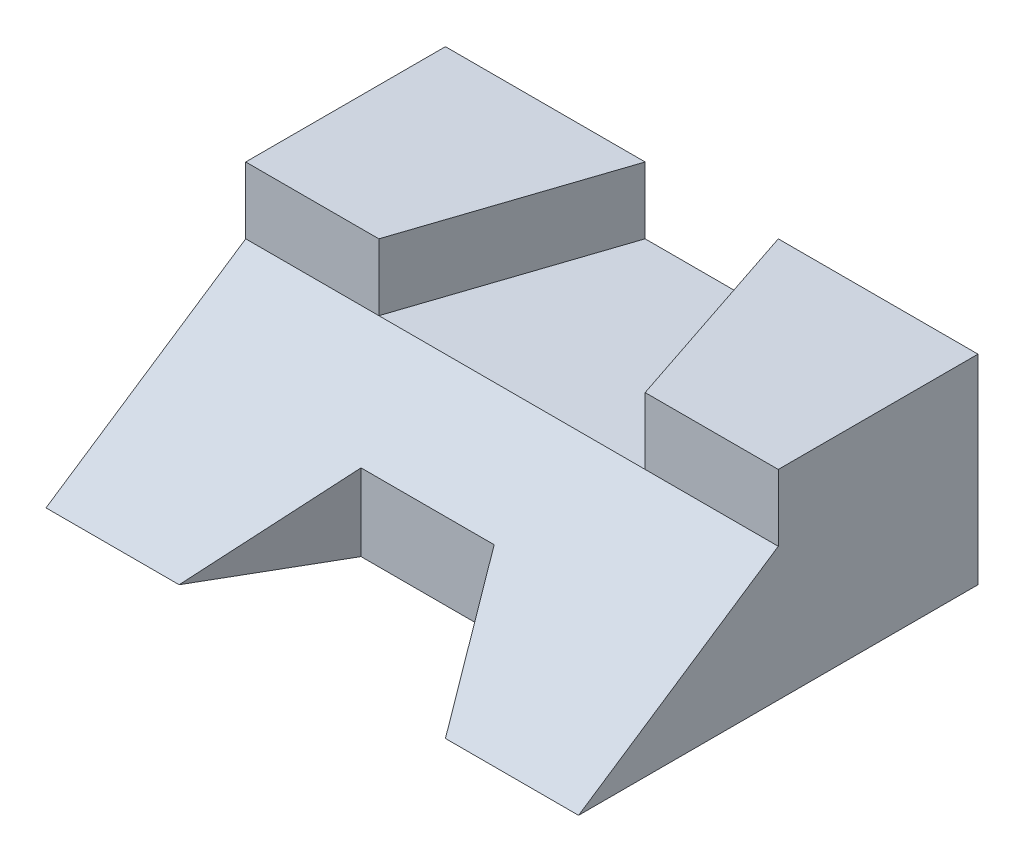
from build123d import *

# Parameters (mm, degrees)
EXTRUDE1_DEPTH     = 101.6
CUT_EXTRUDE1_DEPTH = 25.4
CUT_EXTRUDE2_DEPTH = 199.380341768


with BuildPart() as part:
    # Sketch1 → Extrude1 (new, symmetric)
    with BuildSketch(Plane(origin=(0, 0, 0), x_dir=(0, 0, -1), z_dir=(1, 0, 0))):
        Polygon((0, 0), (152.4, 0), (152.4, 76.2), (76.2, 76.2), (76.2, 50.8), align=None)
    extrude(amount=EXTRUDE1_DEPTH, both=True)

    # Sketch2 → Cut-Extrude1 (cut)
    with BuildSketch(Plane(origin=(0, 76.2, 0), x_dir=(-1, 0, 0), z_dir=(0, 1, 0))):
        Polygon((50.8, -76.2), (-50.8, -76.2), (-25.4, -152.4), (25.4, -152.4), align=None)
    extrude(amount=-CUT_EXTRUDE1_DEPTH, mode=Mode.SUBTRACT)

    # Sketch3 → Cut-Extrude2 (cut, through all)
    with BuildSketch(Plane.XZ):
        Polygon((-50.8, 0), (50.8, 0), (25.4, -43.994090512), (-25.4, -43.994090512), align=None)
    extrude(amount=-CUT_EXTRUDE2_DEPTH, mode=Mode.SUBTRACT)


solid = part.part
